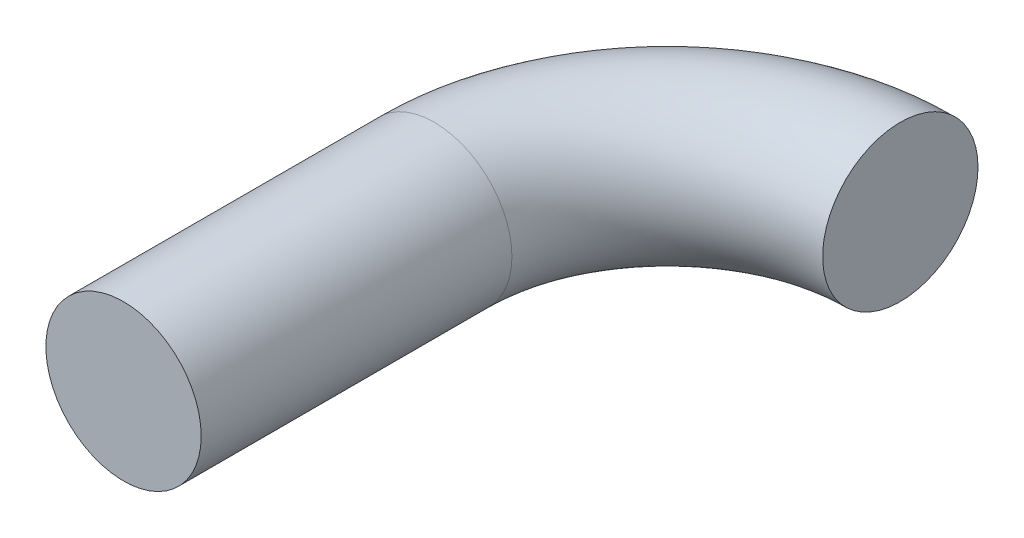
ISO-10303-21;
HEADER;
FILE_DESCRIPTION(('STEP AP214'),'2;1');
FILE_NAME('part.step','',(''),(''),'','','');
FILE_SCHEMA(('AUTOMOTIVE_DESIGN { 1 0 10303 214 1 1 1 1 }'));
ENDSEC;
DATA;
#1=APPLICATION_CONTEXT('core data for automotive mechanical design processes');
#2=APPLICATION_PROTOCOL_DEFINITION('international standard','automotive_design',2000,#1);
#3=PRODUCT_CONTEXT('',#1,'mechanical');
#4=PRODUCT('Part','Part','',(#3));
#5=PRODUCT_RELATED_PRODUCT_CATEGORY('part','',(#4));
#6=PRODUCT_DEFINITION_FORMATION('','',#4);
#7=PRODUCT_DEFINITION_CONTEXT('part definition',#1,'design');
#8=PRODUCT_DEFINITION('design','',#6,#7);
#9=PRODUCT_DEFINITION_SHAPE('','',#8);
#10=(LENGTH_UNIT() NAMED_UNIT(*) SI_UNIT(.MILLI.,.METRE.));
#11=(NAMED_UNIT(*) PLANE_ANGLE_UNIT() SI_UNIT($,.RADIAN.));
#12=(NAMED_UNIT(*) SI_UNIT($,.STERADIAN.) SOLID_ANGLE_UNIT());
#13=UNCERTAINTY_MEASURE_WITH_UNIT(LENGTH_MEASURE(1.E-05),#10,'distance_accuracy_value','');
#14=(GEOMETRIC_REPRESENTATION_CONTEXT(3) GLOBAL_UNCERTAINTY_ASSIGNED_CONTEXT((#13)) GLOBAL_UNIT_ASSIGNED_CONTEXT((#10,
#11,#12)) REPRESENTATION_CONTEXT('',''));
#15=CARTESIAN_POINT('',(0.,0.,0.));
#16=DIRECTION('',(0.,0.,1.));
#17=DIRECTION('',(1.,0.,0.));
#18=AXIS2_PLACEMENT_3D('',#15,#16,#17);
#19=CARTESIAN_POINT('',(76.2,0.,-101.6));
#20=DIRECTION('',(0.,-1.,0.));
#21=DIRECTION('',(0.,0.,-1.));
#22=AXIS2_PLACEMENT_3D('',#19,#20,#21);
#23=TOROIDAL_SURFACE('',#22,76.2,25.4);
#24=CARTESIAN_POINT('',(0.,0.,-101.6));
#25=DIRECTION('',(0.,0.,1.));
#26=DIRECTION('',(1.,0.,0.));
#27=AXIS2_PLACEMENT_3D('',#24,#25,#26);
#28=CIRCLE('',#27,25.4);
#29=CARTESIAN_POINT('',(-25.4,0.,-101.6));
#30=VERTEX_POINT('',#29);
#31=EDGE_CURVE('E35',#30,#30,#28,.T.);
#32=CARTESIAN_POINT('',(76.2000000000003,0.,-177.8));
#33=DIRECTION('',(-1.,0.,0.));
#34=DIRECTION('',(0.,0.,1.));
#35=AXIS2_PLACEMENT_3D('',#32,#33,#34);
#36=CIRCLE('',#35,25.4);
#37=CARTESIAN_POINT('',(76.2000000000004,0.,-203.2));
#38=VERTEX_POINT('',#37);
#39=EDGE_CURVE('E10',#38,#38,#36,.T.);
#40=CARTESIAN_POINT('',(76.2,0.,-101.6));
#41=DIRECTION('',(0.,-1.,0.));
#42=DIRECTION('',(0.,0.,-1.));
#43=AXIS2_PLACEMENT_3D('',#40,#41,#42);
#44=CIRCLE('',#43,101.6);
#45=EDGE_CURVE('',#30,#38,#44,.T.);
#46=ORIENTED_EDGE('',*,*,#31,.F.);
#47=ORIENTED_EDGE('',*,*,#39,.T.);
#48=ORIENTED_EDGE('',*,*,#45,.T.);
#49=ORIENTED_EDGE('',*,*,#45,.F.);
#50=EDGE_LOOP('',(#46,#48,#47,#49));
#51=FACE_BOUND('',#50,.T.);
#52=ADVANCED_FACE('F29',(#51),#23,.T.);
#53=CARTESIAN_POINT('',(0.,0.,-101.6));
#54=DIRECTION('',(0.,0.,1.));
#55=DIRECTION('',(1.,0.,0.));
#56=AXIS2_PLACEMENT_3D('',#53,#54,#55);
#57=CYLINDRICAL_SURFACE('',#56,25.4);
#58=ORIENTED_EDGE('',*,*,#31,.T.);
#59=EDGE_LOOP('',(#58));
#60=FACE_BOUND('',#59,.T.);
#61=CARTESIAN_POINT('',(0.,0.,0.));
#62=DIRECTION('',(0.,0.,1.));
#63=DIRECTION('',(1.,0.,0.));
#64=AXIS2_PLACEMENT_3D('',#61,#62,#63);
#65=CIRCLE('',#64,25.4);
#66=CARTESIAN_POINT('',(25.4,0.,0.));
#67=VERTEX_POINT('',#66);
#68=EDGE_CURVE('E39',#67,#67,#65,.T.);
#69=ORIENTED_EDGE('',*,*,#68,.F.);
#70=EDGE_LOOP('',(#69));
#71=FACE_BOUND('',#70,.T.);
#72=ADVANCED_FACE('F48',(#60,#71),#57,.T.);
#73=CARTESIAN_POINT('',(76.2000000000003,0.,-177.8));
#74=DIRECTION('',(-1.,0.,0.));
#75=DIRECTION('',(0.,0.,1.));
#76=AXIS2_PLACEMENT_3D('',#73,#74,#75);
#77=PLANE('',#76);
#78=ORIENTED_EDGE('',*,*,#39,.F.);
#79=EDGE_LOOP('',(#78));
#80=FACE_BOUND('',#79,.T.);
#81=ADVANCED_FACE('F50',(#80),#77,.F.);
#82=CARTESIAN_POINT('',(0.,0.,0.));
#83=DIRECTION('',(0.,0.,1.));
#84=DIRECTION('',(1.,0.,0.));
#85=AXIS2_PLACEMENT_3D('',#82,#83,#84);
#86=PLANE('',#85);
#87=ORIENTED_EDGE('',*,*,#68,.T.);
#88=EDGE_LOOP('',(#87));
#89=FACE_BOUND('',#88,.T.);
#90=ADVANCED_FACE('F46',(#89),#86,.T.);
#91=CLOSED_SHELL('',(#52,#72,#81,#90));
#92=MANIFOLD_SOLID_BREP('B2',#91);
#93=ADVANCED_BREP_SHAPE_REPRESENTATION('',(#18,#92),#14);
#94=SHAPE_DEFINITION_REPRESENTATION(#9,#93);
ENDSEC;
END-ISO-10303-21;
